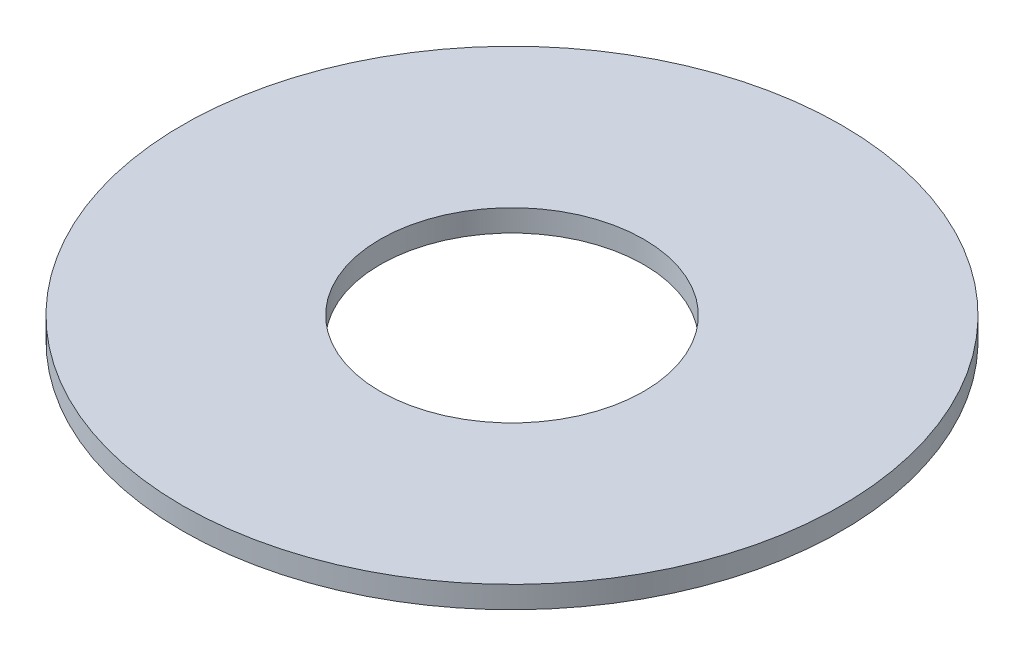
from build123d import *

# Parameters (mm, degrees)
SKETCH1_R           = 7.5
SKETCH1_R_2         = 3
BOSS_EXTRUDE1_DEPTH = 0.5


with BuildPart() as part:
    # Sketch1 → Boss-Extrude1 (new body)
    with BuildSketch(Plane(origin=(0, 0, 0), x_dir=(1, 0, 0), z_dir=(0, 1, 0))):
        with Locations(Location((0, 0, 0), (0, 0, 270))):
            Circle(SKETCH1_R)
        with Locations(Location((0, 0, 0), (0, 0, 270))):
            Circle(SKETCH1_R_2, mode=Mode.SUBTRACT)
    extrude(amount=BOSS_EXTRUDE1_DEPTH)


solid = part.part
